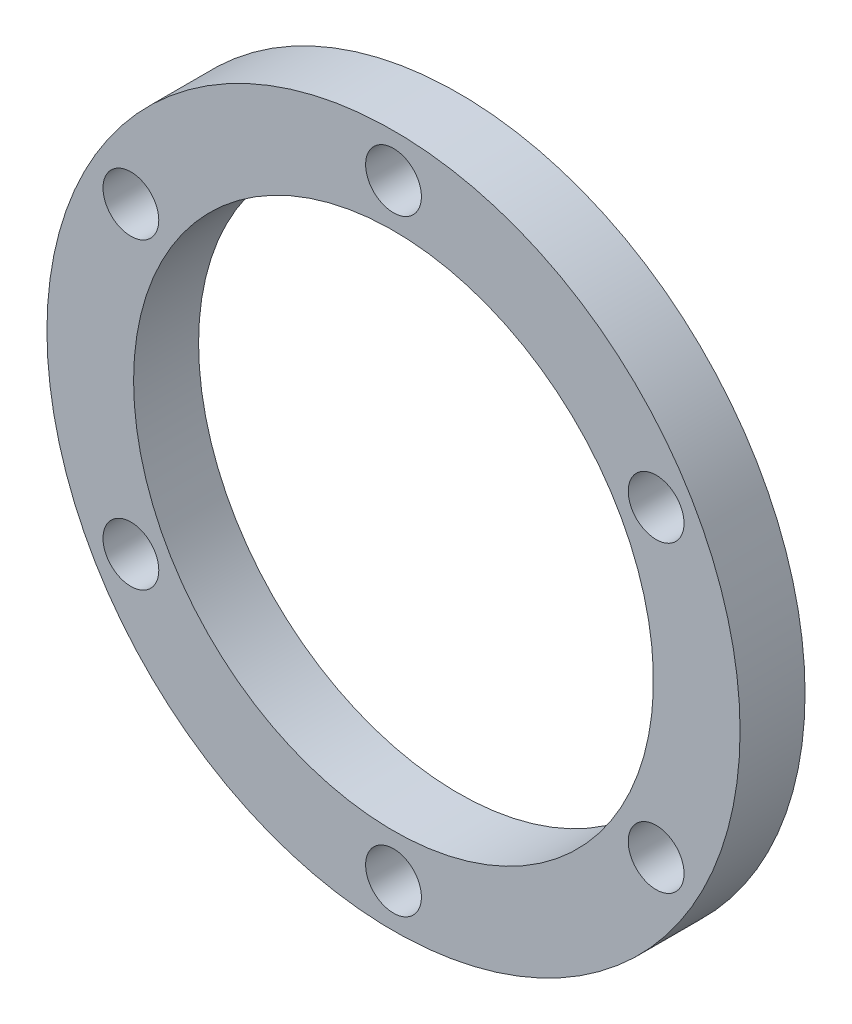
ISO-10303-21;
HEADER;
FILE_DESCRIPTION(('STEP AP214'),'2;1');
FILE_NAME('part.step','',(''),(''),'','','');
FILE_SCHEMA(('AUTOMOTIVE_DESIGN { 1 0 10303 214 1 1 1 1 }'));
ENDSEC;
DATA;
#1=APPLICATION_CONTEXT('core data for automotive mechanical design processes');
#2=APPLICATION_PROTOCOL_DEFINITION('international standard','automotive_design',2000,#1);
#3=PRODUCT_CONTEXT('',#1,'mechanical');
#4=PRODUCT('Part','Part','',(#3));
#5=PRODUCT_RELATED_PRODUCT_CATEGORY('part','',(#4));
#6=PRODUCT_DEFINITION_FORMATION('','',#4);
#7=PRODUCT_DEFINITION_CONTEXT('part definition',#1,'design');
#8=PRODUCT_DEFINITION('design','',#6,#7);
#9=PRODUCT_DEFINITION_SHAPE('','',#8);
#10=(LENGTH_UNIT() NAMED_UNIT(*) SI_UNIT(.MILLI.,.METRE.));
#11=(NAMED_UNIT(*) PLANE_ANGLE_UNIT() SI_UNIT($,.RADIAN.));
#12=(NAMED_UNIT(*) SI_UNIT($,.STERADIAN.) SOLID_ANGLE_UNIT());
#13=UNCERTAINTY_MEASURE_WITH_UNIT(LENGTH_MEASURE(1.E-05),#10,'distance_accuracy_value','');
#14=(GEOMETRIC_REPRESENTATION_CONTEXT(3) GLOBAL_UNCERTAINTY_ASSIGNED_CONTEXT((#13)) GLOBAL_UNIT_ASSIGNED_CONTEXT((#10,
#11,#12)) REPRESENTATION_CONTEXT('',''));
#15=CARTESIAN_POINT('',(0.,0.,0.));
#16=DIRECTION('',(0.,0.,1.));
#17=DIRECTION('',(1.,0.,0.));
#18=AXIS2_PLACEMENT_3D('',#15,#16,#17);
#19=CARTESIAN_POINT('',(0.,0.,4.7625));
#20=DIRECTION('',(0.,0.,1.));
#21=DIRECTION('',(1.,0.,0.));
#22=AXIS2_PLACEMENT_3D('',#19,#20,#21);
#23=PLANE('',#22);
#24=CARTESIAN_POINT('',(-19.247414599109,11.1125000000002,4.7625));
#25=DIRECTION('',(0.,0.,1.));
#26=DIRECTION('',(1.,0.,0.));
#27=AXIS2_PLACEMENT_3D('',#24,#25,#26);
#28=CIRCLE('',#27,2.0447);
#29=CARTESIAN_POINT('',(-17.202714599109,11.1125000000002,4.7625));
#30=VERTEX_POINT('',#29);
#31=EDGE_CURVE('E86',#30,#30,#28,.T.);
#32=ORIENTED_EDGE('',*,*,#31,.F.);
#33=EDGE_LOOP('',(#32));
#34=FACE_BOUND('',#33,.T.);
#35=CARTESIAN_POINT('',(-19.2474145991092,-11.1124999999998,4.7625));
#36=DIRECTION('',(0.,0.,1.));
#37=DIRECTION('',(1.,0.,0.));
#38=AXIS2_PLACEMENT_3D('',#35,#36,#37);
#39=CIRCLE('',#38,2.0447);
#40=CARTESIAN_POINT('',(-17.2027145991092,-11.1124999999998,4.7625));
#41=VERTEX_POINT('',#40);
#42=EDGE_CURVE('E80',#41,#41,#39,.T.);
#43=ORIENTED_EDGE('',*,*,#42,.F.);
#44=EDGE_LOOP('',(#43));
#45=FACE_BOUND('',#44,.T.);
#46=CARTESIAN_POINT('',(0.,-22.225,4.7625));
#47=DIRECTION('',(0.,0.,1.));
#48=DIRECTION('',(1.,0.,0.));
#49=AXIS2_PLACEMENT_3D('',#46,#47,#48);
#50=CIRCLE('',#49,2.0447);
#51=CARTESIAN_POINT('',(2.0447,-22.225,4.7625));
#52=VERTEX_POINT('',#51);
#53=EDGE_CURVE('E74',#52,#52,#50,.T.);
#54=ORIENTED_EDGE('',*,*,#53,.F.);
#55=EDGE_LOOP('',(#54));
#56=FACE_BOUND('',#55,.T.);
#57=CARTESIAN_POINT('',(19.2474145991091,-11.1125000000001,4.7625));
#58=DIRECTION('',(0.,0.,1.));
#59=DIRECTION('',(1.,0.,0.));
#60=AXIS2_PLACEMENT_3D('',#57,#58,#59);
#61=CIRCLE('',#60,2.0447);
#62=CARTESIAN_POINT('',(21.2921145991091,-11.1125000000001,4.7625));
#63=VERTEX_POINT('',#62);
#64=EDGE_CURVE('E68',#63,#63,#61,.T.);
#65=ORIENTED_EDGE('',*,*,#64,.F.);
#66=EDGE_LOOP('',(#65));
#67=FACE_BOUND('',#66,.T.);
#68=CARTESIAN_POINT('',(19.2474145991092,11.1125,4.7625));
#69=DIRECTION('',(0.,0.,1.));
#70=DIRECTION('',(1.,0.,0.));
#71=AXIS2_PLACEMENT_3D('',#68,#69,#70);
#72=CIRCLE('',#71,2.0447);
#73=CARTESIAN_POINT('',(21.2921145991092,11.1125,4.7625));
#74=VERTEX_POINT('',#73);
#75=EDGE_CURVE('E62',#74,#74,#72,.T.);
#76=ORIENTED_EDGE('',*,*,#75,.F.);
#77=EDGE_LOOP('',(#76));
#78=FACE_BOUND('',#77,.T.);
#79=CARTESIAN_POINT('',(0.,22.225,4.7625));
#80=DIRECTION('',(0.,0.,1.));
#81=DIRECTION('',(1.,0.,0.));
#82=AXIS2_PLACEMENT_3D('',#79,#80,#81);
#83=CIRCLE('',#82,2.0447);
#84=CARTESIAN_POINT('',(2.0447,22.225,4.7625));
#85=VERTEX_POINT('',#84);
#86=EDGE_CURVE('E56',#85,#85,#83,.T.);
#87=ORIENTED_EDGE('',*,*,#86,.F.);
#88=EDGE_LOOP('',(#87));
#89=FACE_BOUND('',#88,.T.);
#90=CARTESIAN_POINT('',(0.,0.,4.7625));
#91=DIRECTION('',(0.,0.,1.));
#92=DIRECTION('',(1.,0.,0.));
#93=AXIS2_PLACEMENT_3D('',#90,#91,#92);
#94=CIRCLE('',#93,25.4);
#95=CARTESIAN_POINT('',(-25.4,0.,4.7625));
#96=VERTEX_POINT('',#95);
#97=EDGE_CURVE('E10',#96,#96,#94,.T.);
#98=ORIENTED_EDGE('',*,*,#97,.T.);
#99=EDGE_LOOP('',(#98));
#100=FACE_BOUND('',#99,.T.);
#101=CARTESIAN_POINT('',(0.,0.,4.7625));
#102=DIRECTION('',(0.,0.,1.));
#103=DIRECTION('',(1.,0.,0.));
#104=AXIS2_PLACEMENT_3D('',#101,#102,#103);
#105=CIRCLE('',#104,19.05);
#106=CARTESIAN_POINT('',(-19.05,0.,4.7625));
#107=VERTEX_POINT('',#106);
#108=EDGE_CURVE('E46',#107,#107,#105,.T.);
#109=ORIENTED_EDGE('',*,*,#108,.F.);
#110=EDGE_LOOP('',(#109));
#111=FACE_BOUND('',#110,.T.);
#112=ADVANCED_FACE('F35',(#34,#45,#56,#67,#78,#89,#100,#111),#23,.T.);
#113=CARTESIAN_POINT('',(0.,0.,0.));
#114=DIRECTION('',(0.,0.,1.));
#115=DIRECTION('',(1.,0.,0.));
#116=AXIS2_PLACEMENT_3D('',#113,#114,#115);
#117=PLANE('',#116);
#118=CARTESIAN_POINT('',(-19.247414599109,11.1125000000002,0.));
#119=DIRECTION('',(0.,0.,1.));
#120=DIRECTION('',(1.,0.,0.));
#121=AXIS2_PLACEMENT_3D('',#118,#119,#120);
#122=CIRCLE('',#121,2.0447);
#123=CARTESIAN_POINT('',(-17.202714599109,11.1125000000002,0.));
#124=VERTEX_POINT('',#123);
#125=EDGE_CURVE('E83',#124,#124,#122,.T.);
#126=ORIENTED_EDGE('',*,*,#125,.T.);
#127=EDGE_LOOP('',(#126));
#128=FACE_BOUND('',#127,.T.);
#129=CARTESIAN_POINT('',(-19.2474145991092,-11.1124999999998,0.));
#130=DIRECTION('',(0.,0.,1.));
#131=DIRECTION('',(1.,0.,0.));
#132=AXIS2_PLACEMENT_3D('',#129,#130,#131);
#133=CIRCLE('',#132,2.0447);
#134=CARTESIAN_POINT('',(-17.2027145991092,-11.1124999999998,0.));
#135=VERTEX_POINT('',#134);
#136=EDGE_CURVE('E77',#135,#135,#133,.T.);
#137=ORIENTED_EDGE('',*,*,#136,.T.);
#138=EDGE_LOOP('',(#137));
#139=FACE_BOUND('',#138,.T.);
#140=CARTESIAN_POINT('',(0.,-22.225,0.));
#141=DIRECTION('',(0.,0.,1.));
#142=DIRECTION('',(1.,0.,0.));
#143=AXIS2_PLACEMENT_3D('',#140,#141,#142);
#144=CIRCLE('',#143,2.0447);
#145=CARTESIAN_POINT('',(2.0447,-22.225,0.));
#146=VERTEX_POINT('',#145);
#147=EDGE_CURVE('E71',#146,#146,#144,.T.);
#148=ORIENTED_EDGE('',*,*,#147,.T.);
#149=EDGE_LOOP('',(#148));
#150=FACE_BOUND('',#149,.T.);
#151=CARTESIAN_POINT('',(19.2474145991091,-11.1125000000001,0.));
#152=DIRECTION('',(0.,0.,1.));
#153=DIRECTION('',(1.,0.,0.));
#154=AXIS2_PLACEMENT_3D('',#151,#152,#153);
#155=CIRCLE('',#154,2.0447);
#156=CARTESIAN_POINT('',(21.2921145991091,-11.1125000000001,0.));
#157=VERTEX_POINT('',#156);
#158=EDGE_CURVE('E65',#157,#157,#155,.T.);
#159=ORIENTED_EDGE('',*,*,#158,.T.);
#160=EDGE_LOOP('',(#159));
#161=FACE_BOUND('',#160,.T.);
#162=CARTESIAN_POINT('',(19.2474145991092,11.1125,0.));
#163=DIRECTION('',(0.,0.,1.));
#164=DIRECTION('',(1.,0.,0.));
#165=AXIS2_PLACEMENT_3D('',#162,#163,#164);
#166=CIRCLE('',#165,2.0447);
#167=CARTESIAN_POINT('',(21.2921145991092,11.1125,0.));
#168=VERTEX_POINT('',#167);
#169=EDGE_CURVE('E59',#168,#168,#166,.T.);
#170=ORIENTED_EDGE('',*,*,#169,.T.);
#171=EDGE_LOOP('',(#170));
#172=FACE_BOUND('',#171,.T.);
#173=CARTESIAN_POINT('',(0.,22.225,0.));
#174=DIRECTION('',(0.,0.,1.));
#175=DIRECTION('',(1.,0.,0.));
#176=AXIS2_PLACEMENT_3D('',#173,#174,#175);
#177=CIRCLE('',#176,2.0447);
#178=CARTESIAN_POINT('',(2.0447,22.225,0.));
#179=VERTEX_POINT('',#178);
#180=EDGE_CURVE('E51',#179,#179,#177,.T.);
#181=ORIENTED_EDGE('',*,*,#180,.T.);
#182=EDGE_LOOP('',(#181));
#183=FACE_BOUND('',#182,.T.);
#184=CARTESIAN_POINT('',(0.,0.,0.));
#185=DIRECTION('',(0.,0.,1.));
#186=DIRECTION('',(1.,0.,0.));
#187=AXIS2_PLACEMENT_3D('',#184,#185,#186);
#188=CIRCLE('',#187,25.4);
#189=CARTESIAN_POINT('',(-25.4,0.,0.));
#190=VERTEX_POINT('',#189);
#191=EDGE_CURVE('E39',#190,#190,#188,.T.);
#192=ORIENTED_EDGE('',*,*,#191,.F.);
#193=EDGE_LOOP('',(#192));
#194=FACE_BOUND('',#193,.T.);
#195=CARTESIAN_POINT('',(0.,0.,0.));
#196=DIRECTION('',(0.,0.,1.));
#197=DIRECTION('',(1.,0.,0.));
#198=AXIS2_PLACEMENT_3D('',#195,#196,#197);
#199=CIRCLE('',#198,19.05);
#200=CARTESIAN_POINT('',(-19.05,0.,0.));
#201=VERTEX_POINT('',#200);
#202=EDGE_CURVE('E48',#201,#201,#199,.T.);
#203=ORIENTED_EDGE('',*,*,#202,.T.);
#204=EDGE_LOOP('',(#203));
#205=FACE_BOUND('',#204,.T.);
#206=ADVANCED_FACE('F94',(#128,#139,#150,#161,#172,#183,#194,#205),#117,.F.);
#207=CARTESIAN_POINT('',(0.,0.,4.7625));
#208=DIRECTION('',(0.,0.,-1.));
#209=DIRECTION('',(-1.,0.,0.));
#210=AXIS2_PLACEMENT_3D('',#207,#208,#209);
#211=CYLINDRICAL_SURFACE('',#210,25.4);
#212=CARTESIAN_POINT('',(-25.4,0.,4.7625));
#213=CARTESIAN_POINT('',(-25.4,0.,4.712890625));
#214=CARTESIAN_POINT('',(-25.4,0.,4.66328125));
#215=CARTESIAN_POINT('',(-25.4,0.,4.5640625));
#216=CARTESIAN_POINT('',(-25.4,0.,4.514453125));
#217=CARTESIAN_POINT('',(-25.4,0.,4.415234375));
#218=CARTESIAN_POINT('',(-25.4,0.,4.365625));
#219=CARTESIAN_POINT('',(-25.4,0.,4.26640625));
#220=CARTESIAN_POINT('',(-25.4,0.,4.216796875));
#221=CARTESIAN_POINT('',(-25.4,0.,4.117578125));
#222=CARTESIAN_POINT('',(-25.4,0.,4.06796875));
#223=CARTESIAN_POINT('',(-25.4,0.,3.96875));
#224=CARTESIAN_POINT('',(-25.4,0.,3.919140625));
#225=CARTESIAN_POINT('',(-25.4,0.,3.819921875));
#226=CARTESIAN_POINT('',(-25.4,0.,3.7703125));
#227=CARTESIAN_POINT('',(-25.4,0.,3.67109375));
#228=CARTESIAN_POINT('',(-25.4,0.,3.621484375));
#229=CARTESIAN_POINT('',(-25.4,0.,3.522265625));
#230=CARTESIAN_POINT('',(-25.4,0.,3.47265625));
#231=CARTESIAN_POINT('',(-25.4,0.,3.3734375));
#232=CARTESIAN_POINT('',(-25.4,0.,3.323828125));
#233=CARTESIAN_POINT('',(-25.4,0.,3.224609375));
#234=CARTESIAN_POINT('',(-25.4,0.,3.175));
#235=CARTESIAN_POINT('',(-25.4,0.,3.07578125));
#236=CARTESIAN_POINT('',(-25.4,0.,3.026171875));
#237=CARTESIAN_POINT('',(-25.4,0.,2.926953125));
#238=CARTESIAN_POINT('',(-25.4,0.,2.87734375));
#239=CARTESIAN_POINT('',(-25.4,0.,2.778125));
#240=CARTESIAN_POINT('',(-25.4,0.,2.728515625));
#241=CARTESIAN_POINT('',(-25.4,0.,2.629296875));
#242=CARTESIAN_POINT('',(-25.4,0.,2.5796875));
#243=CARTESIAN_POINT('',(-25.4,0.,2.48046875));
#244=CARTESIAN_POINT('',(-25.4,0.,2.430859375));
#245=CARTESIAN_POINT('',(-25.4,0.,2.331640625));
#246=CARTESIAN_POINT('',(-25.4,0.,2.28203125));
#247=CARTESIAN_POINT('',(-25.4,0.,2.1828125));
#248=CARTESIAN_POINT('',(-25.4,0.,2.133203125));
#249=CARTESIAN_POINT('',(-25.4,0.,2.033984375));
#250=CARTESIAN_POINT('',(-25.4,0.,1.984375));
#251=CARTESIAN_POINT('',(-25.4,0.,1.88515625));
#252=CARTESIAN_POINT('',(-25.4,0.,1.835546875));
#253=CARTESIAN_POINT('',(-25.4,0.,1.736328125));
#254=CARTESIAN_POINT('',(-25.4,0.,1.68671875));
#255=CARTESIAN_POINT('',(-25.4,0.,1.5875));
#256=CARTESIAN_POINT('',(-25.4,0.,1.537890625));
#257=CARTESIAN_POINT('',(-25.4,0.,1.438671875));
#258=CARTESIAN_POINT('',(-25.4,0.,1.3890625));
#259=CARTESIAN_POINT('',(-25.4,0.,1.28984375));
#260=CARTESIAN_POINT('',(-25.4,0.,1.240234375));
#261=CARTESIAN_POINT('',(-25.4,0.,1.141015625));
#262=CARTESIAN_POINT('',(-25.4,0.,1.09140625));
#263=CARTESIAN_POINT('',(-25.4,0.,0.9921875));
#264=CARTESIAN_POINT('',(-25.4,0.,0.942578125));
#265=CARTESIAN_POINT('',(-25.4,0.,0.843359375));
#266=CARTESIAN_POINT('',(-25.4,0.,0.79375));
#267=CARTESIAN_POINT('',(-25.4,0.,0.69453125));
#268=CARTESIAN_POINT('',(-25.4,0.,0.644921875));
#269=CARTESIAN_POINT('',(-25.4,0.,0.545703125));
#270=CARTESIAN_POINT('',(-25.4,0.,0.49609375));
#271=CARTESIAN_POINT('',(-25.4,0.,0.396875));
#272=CARTESIAN_POINT('',(-25.4,0.,0.347265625));
#273=CARTESIAN_POINT('',(-25.4,0.,0.248046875));
#274=CARTESIAN_POINT('',(-25.4,0.,0.1984375));
#275=CARTESIAN_POINT('',(-25.4,0.,0.09921875));
#276=CARTESIAN_POINT('',(-25.4,0.,0.049609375));
#277=CARTESIAN_POINT('',(-25.4,0.,0.));
#278=B_SPLINE_CURVE_WITH_KNOTS('',3,(#212,#213,#214,#215,#216,#217,#218,#219,#220,#221,#222,
#223,#224,#225,#226,#227,#228,#229,#230,#231,#232,#233,#234,#235,#236,#237,#238,#239,#240,#241,
#242,#243,#244,#245,#246,#247,#248,#249,#250,#251,#252,#253,#254,#255,#256,#257,#258,#259,#260,
#261,#262,#263,#264,#265,#266,#267,#268,#269,#270,#271,#272,#273,#274,#275,#276,#277),
.UNSPECIFIED.,.F.,.F.,(4,2,2,2,2,2,2,2,2,2,2,2,2,2,2,2,2,2,2,2,2,2,2,2,2,2,2,2,2,2,2,2,4),(0.,
0.148828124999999,0.297656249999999,0.446484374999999,0.595312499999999,0.744140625,0.89296875,
1.041796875,1.190625,1.339453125,1.48828125,1.637109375,1.7859375,1.934765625,2.08359375,
2.232421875,2.38125,2.530078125,2.67890625,2.827734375,2.9765625,3.125390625,3.27421875,
3.423046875,3.571875,3.720703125,3.86953125,4.018359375,4.1671875,4.316015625,4.46484375,
4.613671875,4.7625),.UNSPECIFIED.);
#279=EDGE_CURVE('BSEAM37',#96,#190,#278,.T.);
#280=ORIENTED_EDGE('',*,*,#97,.F.);
#281=ORIENTED_EDGE('',*,*,#191,.T.);
#282=ORIENTED_EDGE('',*,*,#279,.T.);
#283=ORIENTED_EDGE('',*,*,#279,.F.);
#284=EDGE_LOOP('',(#280,#282,#281,#283));
#285=FACE_BOUND('',#284,.T.);
#286=ADVANCED_FACE('F37',(#285),#211,.T.);
#287=CARTESIAN_POINT('',(0.,0.,4.7625));
#288=DIRECTION('',(0.,0.,-1.));
#289=DIRECTION('',(-1.,0.,0.));
#290=AXIS2_PLACEMENT_3D('',#287,#288,#289);
#291=CYLINDRICAL_SURFACE('',#290,19.05);
#292=CARTESIAN_POINT('',(-19.05,0.,4.7625));
#293=CARTESIAN_POINT('',(-19.05,0.,4.712890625));
#294=CARTESIAN_POINT('',(-19.05,0.,4.66328125));
#295=CARTESIAN_POINT('',(-19.05,0.,4.5640625));
#296=CARTESIAN_POINT('',(-19.05,0.,4.514453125));
#297=CARTESIAN_POINT('',(-19.05,0.,4.415234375));
#298=CARTESIAN_POINT('',(-19.05,0.,4.365625));
#299=CARTESIAN_POINT('',(-19.05,0.,4.26640625));
#300=CARTESIAN_POINT('',(-19.05,0.,4.216796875));
#301=CARTESIAN_POINT('',(-19.05,0.,4.117578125));
#302=CARTESIAN_POINT('',(-19.05,0.,4.06796875));
#303=CARTESIAN_POINT('',(-19.05,0.,3.96875));
#304=CARTESIAN_POINT('',(-19.05,0.,3.919140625));
#305=CARTESIAN_POINT('',(-19.05,0.,3.819921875));
#306=CARTESIAN_POINT('',(-19.05,0.,3.7703125));
#307=CARTESIAN_POINT('',(-19.05,0.,3.67109375));
#308=CARTESIAN_POINT('',(-19.05,0.,3.621484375));
#309=CARTESIAN_POINT('',(-19.05,0.,3.522265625));
#310=CARTESIAN_POINT('',(-19.05,0.,3.47265625));
#311=CARTESIAN_POINT('',(-19.05,0.,3.3734375));
#312=CARTESIAN_POINT('',(-19.05,0.,3.323828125));
#313=CARTESIAN_POINT('',(-19.05,0.,3.224609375));
#314=CARTESIAN_POINT('',(-19.05,0.,3.175));
#315=CARTESIAN_POINT('',(-19.05,0.,3.07578125));
#316=CARTESIAN_POINT('',(-19.05,0.,3.026171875));
#317=CARTESIAN_POINT('',(-19.05,0.,2.926953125));
#318=CARTESIAN_POINT('',(-19.05,0.,2.87734375));
#319=CARTESIAN_POINT('',(-19.05,0.,2.778125));
#320=CARTESIAN_POINT('',(-19.05,0.,2.728515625));
#321=CARTESIAN_POINT('',(-19.05,0.,2.629296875));
#322=CARTESIAN_POINT('',(-19.05,0.,2.5796875));
#323=CARTESIAN_POINT('',(-19.05,0.,2.48046875));
#324=CARTESIAN_POINT('',(-19.05,0.,2.430859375));
#325=CARTESIAN_POINT('',(-19.05,0.,2.331640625));
#326=CARTESIAN_POINT('',(-19.05,0.,2.28203125));
#327=CARTESIAN_POINT('',(-19.05,0.,2.1828125));
#328=CARTESIAN_POINT('',(-19.05,0.,2.133203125));
#329=CARTESIAN_POINT('',(-19.05,0.,2.033984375));
#330=CARTESIAN_POINT('',(-19.05,0.,1.984375));
#331=CARTESIAN_POINT('',(-19.05,0.,1.88515625));
#332=CARTESIAN_POINT('',(-19.05,0.,1.835546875));
#333=CARTESIAN_POINT('',(-19.05,0.,1.736328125));
#334=CARTESIAN_POINT('',(-19.05,0.,1.68671875));
#335=CARTESIAN_POINT('',(-19.05,0.,1.5875));
#336=CARTESIAN_POINT('',(-19.05,0.,1.537890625));
#337=CARTESIAN_POINT('',(-19.05,0.,1.438671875));
#338=CARTESIAN_POINT('',(-19.05,0.,1.3890625));
#339=CARTESIAN_POINT('',(-19.05,0.,1.28984375));
#340=CARTESIAN_POINT('',(-19.05,0.,1.240234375));
#341=CARTESIAN_POINT('',(-19.05,0.,1.141015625));
#342=CARTESIAN_POINT('',(-19.05,0.,1.09140625));
#343=CARTESIAN_POINT('',(-19.05,0.,0.992187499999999));
#344=CARTESIAN_POINT('',(-19.05,0.,0.942578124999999));
#345=CARTESIAN_POINT('',(-19.05,0.,0.843359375));
#346=CARTESIAN_POINT('',(-19.05,0.,0.79375));
#347=CARTESIAN_POINT('',(-19.05,0.,0.69453125));
#348=CARTESIAN_POINT('',(-19.05,0.,0.644921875));
#349=CARTESIAN_POINT('',(-19.05,0.,0.545703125));
#350=CARTESIAN_POINT('',(-19.05,0.,0.49609375));
#351=CARTESIAN_POINT('',(-19.05,0.,0.396875));
#352=CARTESIAN_POINT('',(-19.05,0.,0.347265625));
#353=CARTESIAN_POINT('',(-19.05,0.,0.248046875));
#354=CARTESIAN_POINT('',(-19.05,0.,0.1984375));
#355=CARTESIAN_POINT('',(-19.05,0.,0.09921875));
#356=CARTESIAN_POINT('',(-19.05,0.,0.049609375));
#357=CARTESIAN_POINT('',(-19.05,0.,0.));
#358=B_SPLINE_CURVE_WITH_KNOTS('',3,(#292,#293,#294,#295,#296,#297,#298,#299,#300,#301,#302,
#303,#304,#305,#306,#307,#308,#309,#310,#311,#312,#313,#314,#315,#316,#317,#318,#319,#320,#321,
#322,#323,#324,#325,#326,#327,#328,#329,#330,#331,#332,#333,#334,#335,#336,#337,#338,#339,#340,
#341,#342,#343,#344,#345,#346,#347,#348,#349,#350,#351,#352,#353,#354,#355,#356,#357),
.UNSPECIFIED.,.F.,.F.,(4,2,2,2,2,2,2,2,2,2,2,2,2,2,2,2,2,2,2,2,2,2,2,2,2,2,2,2,2,2,2,2,4),(0.,
0.148828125,0.29765625,0.446484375,0.5953125,0.744140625,0.892968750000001,1.041796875,1.190625,
1.339453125,1.48828125,1.637109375,1.7859375,1.934765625,2.08359375,2.232421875,2.38125,
2.530078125,2.67890625,2.827734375,2.9765625,3.125390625,3.27421875,3.423046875,3.571875,
3.720703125,3.86953125,4.018359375,4.1671875,4.316015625,4.46484375,4.613671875,4.7625),.UNSPECIFIED.);
#359=EDGE_CURVE('BSEAM108',#107,#201,#358,.T.);
#360=ORIENTED_EDGE('',*,*,#108,.T.);
#361=ORIENTED_EDGE('',*,*,#202,.F.);
#362=ORIENTED_EDGE('',*,*,#359,.T.);
#363=ORIENTED_EDGE('',*,*,#359,.F.);
#364=EDGE_LOOP('',(#360,#362,#361,#363));
#365=FACE_BOUND('',#364,.T.);
#366=ADVANCED_FACE('F108',(#365),#291,.F.);
#367=CARTESIAN_POINT('',(0.,22.225,4.7625));
#368=DIRECTION('',(0.,0.,1.));
#369=DIRECTION('',(1.,0.,0.));
#370=AXIS2_PLACEMENT_3D('',#367,#368,#369);
#371=CYLINDRICAL_SURFACE('',#370,2.0447);
#372=ORIENTED_EDGE('',*,*,#180,.F.);
#373=EDGE_LOOP('',(#372));
#374=FACE_BOUND('',#373,.T.);
#375=ORIENTED_EDGE('',*,*,#86,.T.);
#376=EDGE_LOOP('',(#375));
#377=FACE_BOUND('',#376,.T.);
#378=ADVANCED_FACE('F111',(#374,#377),#371,.F.);
#379=CARTESIAN_POINT('',(19.2474145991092,11.1125,4.7625));
#380=DIRECTION('',(0.,0.,1.));
#381=DIRECTION('',(1.,0.,0.));
#382=AXIS2_PLACEMENT_3D('',#379,#380,#381);
#383=CYLINDRICAL_SURFACE('',#382,2.0447);
#384=ORIENTED_EDGE('',*,*,#169,.F.);
#385=EDGE_LOOP('',(#384));
#386=FACE_BOUND('',#385,.T.);
#387=ORIENTED_EDGE('',*,*,#75,.T.);
#388=EDGE_LOOP('',(#387));
#389=FACE_BOUND('',#388,.T.);
#390=ADVANCED_FACE('F125',(#386,#389),#383,.F.);
#391=CARTESIAN_POINT('',(19.2474145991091,-11.1125000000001,4.7625));
#392=DIRECTION('',(0.,0.,1.));
#393=DIRECTION('',(1.,0.,0.));
#394=AXIS2_PLACEMENT_3D('',#391,#392,#393);
#395=CYLINDRICAL_SURFACE('',#394,2.0447);
#396=ORIENTED_EDGE('',*,*,#158,.F.);
#397=EDGE_LOOP('',(#396));
#398=FACE_BOUND('',#397,.T.);
#399=ORIENTED_EDGE('',*,*,#64,.T.);
#400=EDGE_LOOP('',(#399));
#401=FACE_BOUND('',#400,.T.);
#402=ADVANCED_FACE('F129',(#398,#401),#395,.F.);
#403=CARTESIAN_POINT('',(0.,-22.225,4.7625));
#404=DIRECTION('',(0.,0.,1.));
#405=DIRECTION('',(1.,0.,0.));
#406=AXIS2_PLACEMENT_3D('',#403,#404,#405);
#407=CYLINDRICAL_SURFACE('',#406,2.0447);
#408=ORIENTED_EDGE('',*,*,#147,.F.);
#409=EDGE_LOOP('',(#408));
#410=FACE_BOUND('',#409,.T.);
#411=ORIENTED_EDGE('',*,*,#53,.T.);
#412=EDGE_LOOP('',(#411));
#413=FACE_BOUND('',#412,.T.);
#414=ADVANCED_FACE('F133',(#410,#413),#407,.F.);
#415=CARTESIAN_POINT('',(-19.2474145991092,-11.1124999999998,4.7625));
#416=DIRECTION('',(0.,0.,1.));
#417=DIRECTION('',(1.,0.,0.));
#418=AXIS2_PLACEMENT_3D('',#415,#416,#417);
#419=CYLINDRICAL_SURFACE('',#418,2.0447);
#420=ORIENTED_EDGE('',*,*,#136,.F.);
#421=EDGE_LOOP('',(#420));
#422=FACE_BOUND('',#421,.T.);
#423=ORIENTED_EDGE('',*,*,#42,.T.);
#424=EDGE_LOOP('',(#423));
#425=FACE_BOUND('',#424,.T.);
#426=ADVANCED_FACE('F137',(#422,#425),#419,.F.);
#427=CARTESIAN_POINT('',(-19.247414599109,11.1125000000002,4.7625));
#428=DIRECTION('',(0.,0.,1.));
#429=DIRECTION('',(1.,0.,0.));
#430=AXIS2_PLACEMENT_3D('',#427,#428,#429);
#431=CYLINDRICAL_SURFACE('',#430,2.0447);
#432=ORIENTED_EDGE('',*,*,#125,.F.);
#433=EDGE_LOOP('',(#432));
#434=FACE_BOUND('',#433,.T.);
#435=ORIENTED_EDGE('',*,*,#31,.T.);
#436=EDGE_LOOP('',(#435));
#437=FACE_BOUND('',#436,.T.);
#438=ADVANCED_FACE('F90',(#434,#437),#431,.F.);
#439=CLOSED_SHELL('',(#112,#206,#286,#366,#378,#390,#402,#414,#426,#438));
#440=MANIFOLD_SOLID_BREP('B2',#439);
#441=ADVANCED_BREP_SHAPE_REPRESENTATION('',(#18,#440),#14);
#442=SHAPE_DEFINITION_REPRESENTATION(#9,#441);
ENDSEC;
END-ISO-10303-21;
